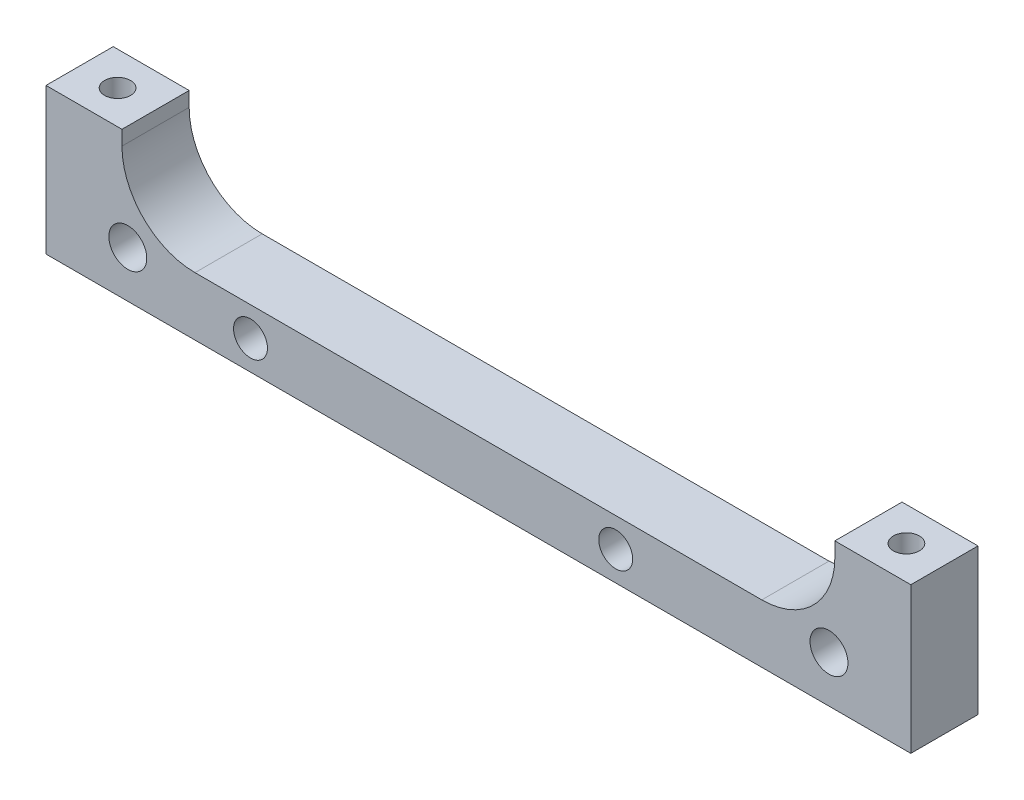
from build123d import *

# Parameters (mm, degrees)
SKETCH1_W                   = 75.184
SKETCH1_H                   = 12.7
EXTRUDE1_DEPTH              = 5.842
SKETCH2_W                   = 61.976
SKETCH2_H                   = 7.62
CUT_EXTRUDE1_DEPTH          = 77.472562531
FILLET1_R                   = 6.35
F_4_40_TAPPED_HOLE3_D       = 2.2606
F_4_40_TAPPED_HOLE3_DEPTH   = 8.509
F_4_40_TAPPED_HOLE3_TIP     = 0.679152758
F_32_0_116_DIAMETER_HOLE2_D = 2.9464
M4X0_7_TAPPED_HOLE1_D       = 3.3


with BuildPart() as part:
    # Sketch1 → Extrude1 (new body)
    with BuildSketch(Plane.XY):
        with Locations((37.592, -6.35)):
            Rectangle(SKETCH1_W, SKETCH1_H)
    extrude(amount=EXTRUDE1_DEPTH)

    # Sketch2 → Cut-Extrude1 (cut, through all)
    with BuildSketch(Plane.XY.offset(5.842)):
        with Locations((37.592, -3.81)):
            Rectangle(SKETCH2_W, SKETCH2_H)
    extrude(amount=-CUT_EXTRUDE1_DEPTH, mode=Mode.SUBTRACT)

    # Fillet1
    fillet1_edges = [part.edges().sort_by_distance(p)[0] for p in [
        (6.604, -7.62, 2.921),
        (68.58, -7.62, 2.921),
    ]]
    fillet(fillet1_edges, radius=FILLET1_R)

    # 4-40 Tapped Hole3
    with Locations(Plane(origin=(0, 0, 0), x_dir=(-1, 0, 0), z_dir=(0, 1, 0))):
        with Locations((-3.302, 2.921), (-71.882, 2.921)):
            Hole(F_4_40_TAPPED_HOLE3_D / 2, depth=F_4_40_TAPPED_HOLE3_DEPTH)
            with Locations((0, 0, -(F_4_40_TAPPED_HOLE3_DEPTH + F_4_40_TAPPED_HOLE3_TIP / 2))):  # 118° drill point
                Cone(0, F_4_40_TAPPED_HOLE3_D / 2, F_4_40_TAPPED_HOLE3_TIP, mode=Mode.SUBTRACT)

    # 32 _0.116_ Diameter Hole2 (through all)
    with Locations(Plane(origin=(0, 0, 0), x_dir=(-1, 0, 0), z_dir=(0, 0, -1))):
        with Locations((-49.53, -10.16), (-17.78, -10.16)):
            Hole(F_32_0_116_DIAMETER_HOLE2_D / 2)

    # M4x0.7 Tapped Hole1 (through all)
    with Locations(Plane(origin=(0, 0, 0), x_dir=(-1, 0, 0), z_dir=(0, 0, -1))):
        with Locations((-68.072, -8.643945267), (-7.112, -8.643945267)):
            Hole(M4X0_7_TAPPED_HOLE1_D / 2)


solid = part.part
